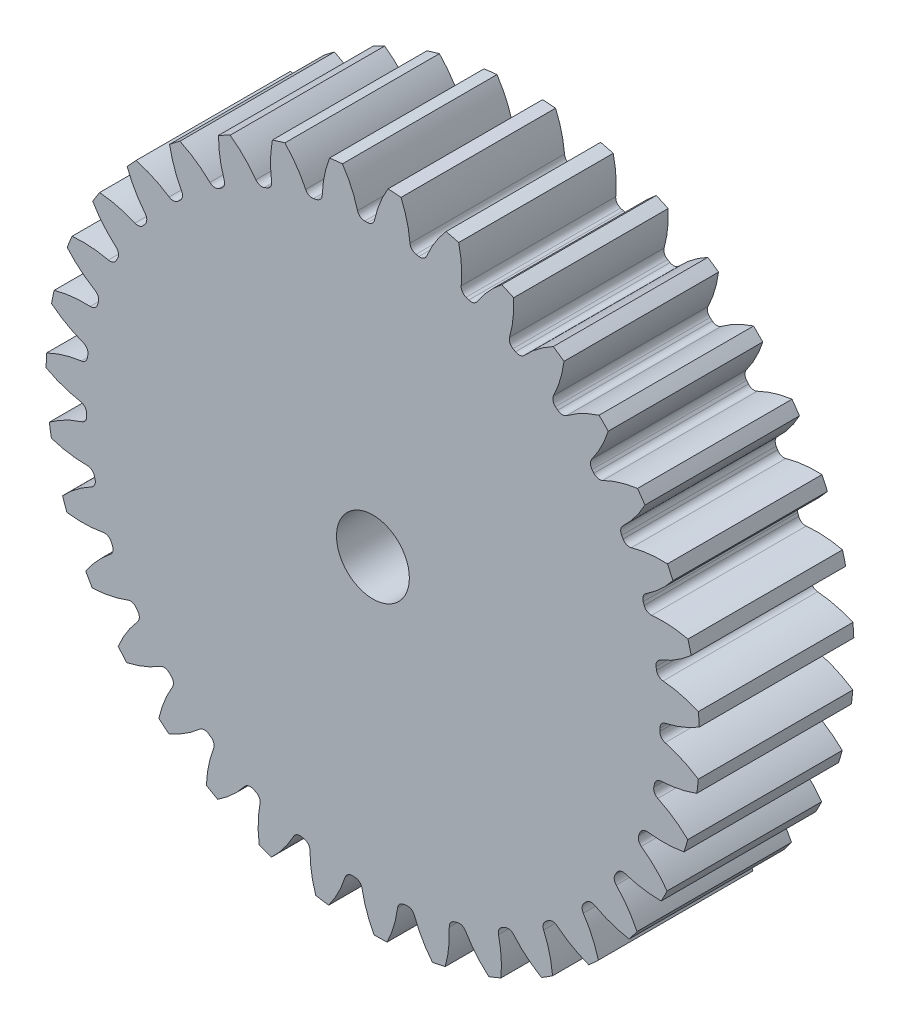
from build123d import *

# Parameters (mm, degrees)
SKETCH3_R         = 187.96
GEARBODY_DEPTH    = 88.9
TOOTHCUT_DEPTH    = 281.287590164
CIRPATTERN1_COUNT = 35
BOREDIA_R         = 20.955
BORE_DEPTH        = 12700


with BuildPart() as part:
    # Sketch3 → gearBody (new body)
    with BuildSketch(Plane.XY):
        Circle(SKETCH3_R)
    extrude(amount=GEARBODY_DEPTH)

    # Sketch2 → toothCut (cut, through all)
    with BuildSketch(Plane.XY):
        with BuildLine():
            ThreePointArc((165.042694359, -4.34960213), (165.062526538, -3.517432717), (165.078162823, -2.685173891))
            ThreePointArc((165.078162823, -2.685173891), (166.007695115, -0.139587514), (168.313778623, 1.283795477))
            ThreePointArc((168.313778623, 1.283795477), (178.467826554, 4.448043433), (187.96, 9.245521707))
            ThreePointArc((187.96, 9.245521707), (188.14453688, -4.009303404), (187.395511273, -17.24423458))
            ThreePointArc((187.395511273, -17.24423458), (178.116327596, -12.04674434), (168.106294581, -8.452805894))
            ThreePointArc((168.106294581, -8.452805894), (165.862940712, -6.932475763), (165.042694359, -4.34960213))
        make_face()
    toothcut = extrude(amount=TOOTHCUT_DEPTH, mode=Mode.SUBTRACT)

    # CirPattern1: toothCut ×35 about axis
    cirpattern1_axis = Axis((0, 0, 0), (0, 0, 1))
    for i in range(1, CIRPATTERN1_COUNT):
        add(toothcut.rotate(cirpattern1_axis, i * 360 / CIRPATTERN1_COUNT), mode=Mode.SUBTRACT)

    # boreDia → bore (cut, symmetric)
    with BuildSketch(Plane.XY):
        Circle(BOREDIA_R)
    extrude(amount=BORE_DEPTH, both=True, mode=Mode.SUBTRACT)


solid = part.part
